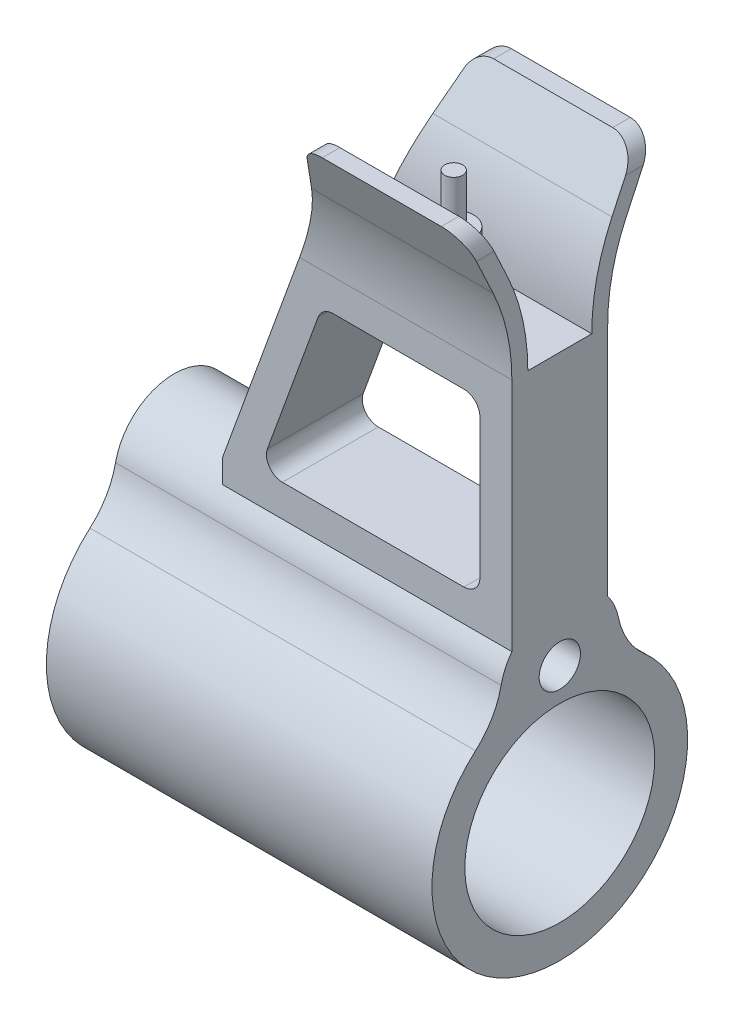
from build123d import *

# Parameters (mm, degrees)
SKETCH3_R           = 11.8872
SKETCH3_R_2         = 2.58445
BOSS_EXTRUDE1_DEPTH = 24.13
SKETCH4_R           = 1.5875
CUT_EXTRUDE3_DEPTH  = 15
BOSS_EXTRUDE2_DEPTH = 6
BOSS_EXTRUDE3_DEPTH = 24.13
BOSS_EXTRUDE4_START = -12
BOSS_EXTRUDE4_DEPTH = 12
CUT_EXTRUDE4_DEPTH  = 12.5
CUT_EXTRUDE5_DEPTH  = 25
CUT_EXTRUDE6_DEPTH  = 25
FILLET1_R           = 2
SKETCH10_R          = 2.5
BOSS_EXTRUDE6_DEPTH = 7
SKETCH12_R          = 1.125
BOSS_EXTRUDE7_DEPTH = 13.10696976


with BuildPart() as part:
    # Sketch3 → Boss-Extrude1 (new, symmetric)
    with BuildSketch(Plane(origin=(0, 0, 0), x_dir=(0, 0, -1), z_dir=(1, 0, 0))):
        with BuildLine():
            ThreePointArc((7.34364611, 17.5234375), (0, 23.5), (-7.34364611, 17.5234375))
            ThreePointArc((-7.34364611, 17.5234375), (-8.496496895, 14.517500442), (-10.544722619, 12.033653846))
            ThreePointArc((-10.544722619, 12.033653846), (0, -16), (10.544722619, 12.033653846))
            ThreePointArc((10.544722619, 12.033653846), (8.496496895, 14.517500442), (7.34364611, 17.5234375))
        make_face()
        with Locations(Location((0, 0, 0), (0, 0, 180))):
            Circle(SKETCH3_R, mode=Mode.SUBTRACT)
        with Locations(Location((0, 16, 0), (0, 0, 180))):
            Circle(SKETCH3_R_2, mode=Mode.SUBTRACT)
    extrude(amount=BOSS_EXTRUDE1_DEPTH, both=True)

    # Sketch4 → Cut-Extrude3 (cut)
    with BuildSketch(Plane(origin=(0, 0, 0), x_dir=(1, 0, 0), z_dir=(0, 1, 0))):
        with Locations(Location((-16.51, 0, 0), (0, 0, 90))):
            Circle(SKETCH4_R)
    extrude(amount=CUT_EXTRUDE3_DEPTH, mode=Mode.SUBTRACT)

    # Sketch5 → Boss-Extrude2 (add, symmetric)
    with BuildSketch(Plane.XY):
        with BuildLine():
            Line((24.13, 20.168652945), (24.13, 23.5))
            Line((24.13, 23.5), (24.13, 64.995396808))
            ThreePointArc((24.13, 64.995396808), (23.251320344, 67.116717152), (21.13, 67.995396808))
            Line((21.13, 67.995396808), (6.230622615, 67.995396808))
            ThreePointArc((6.230622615, 67.995396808), (4.509893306, 67.452852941), (3.411544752, 66.021457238))
            Line((3.411544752, 66.021457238), (-12.065, 23.5))
            Line((-12.065, 23.5), (-12.065, 20.168652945))
            Line((-12.065, 20.168652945), (24.13, 20.168652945))
        make_face()
    extrude(amount=BOSS_EXTRUDE2_DEPTH, both=True)

    # Sketch6 → Boss-Extrude3 (add)
    with BuildSketch(Plane(origin=(0, 0, 0), x_dir=(0, 0, -1), z_dir=(1, 0, 0))):
        with BuildLine():
            Line((-8.342305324, 60.518486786), (-11.828845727, 67.995396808))
            Line((-11.828845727, 67.995396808), (-6, 67.995396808))
            Line((-6, 67.995396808), (-6, 49.953030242))
            ThreePointArc((-6, 49.953030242), (-6.592599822, 55.36402059), (-8.342305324, 60.518486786))
        make_face()
        with BuildLine():
            Line((11.828845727, 67.995396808), (8.342305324, 60.518486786))
            ThreePointArc((8.342305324, 60.518486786), (6.592599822, 55.36402059), (6, 49.953030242))
            Line((6, 49.953030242), (6, 67.995396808))
            Line((6, 67.995396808), (11.828845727, 67.995396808))
        make_face()
    extrude(amount=BOSS_EXTRUDE3_DEPTH)

    # Sketch6_2 → Boss-Extrude4 (add)
    with BuildSketch(Plane(origin=(0, 0, 0), x_dir=(0, 0, -1), z_dir=(1, 0, 0)).offset(BOSS_EXTRUDE4_START)):
        with BuildLine():
            Line((-8.342305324, 60.518486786), (-11.828845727, 67.995396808))
            Line((-11.828845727, 67.995396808), (-6, 67.995396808))
            Line((-6, 67.995396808), (-6, 49.953030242))
            ThreePointArc((-6, 49.953030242), (-6.592599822, 55.36402059), (-8.342305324, 60.518486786))
        make_face()
        with BuildLine():
            Line((11.828845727, 67.995396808), (8.342305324, 60.518486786))
            ThreePointArc((8.342305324, 60.518486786), (6.592599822, 55.36402059), (6, 49.953030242))
            Line((6, 49.953030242), (6, 67.995396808))
            Line((6, 67.995396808), (11.828845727, 67.995396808))
        make_face()
    extrude(amount=BOSS_EXTRUDE4_DEPTH)

    # Sketch7 → Cut-Extrude4 (cut, symmetric)
    with BuildSketch(Plane.XY):
        with BuildLine():
            Line((40.403155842, 121.848988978), (-35.082785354, 121.848988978))
            Line((-35.082785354, 121.848988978), (-35.082785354, 49.953030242))
            Line((-35.082785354, 49.953030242), (-12, 49.953030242))
            Line((-12, 49.953030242), (-2.436884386, 49.953030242))
            Line((-2.436884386, 49.953030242), (3.411544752, 66.021457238))
            ThreePointArc((3.411544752, 66.021457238), (4.509893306, 67.452852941), (6.230622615, 67.995396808))
            Line((6.230622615, 67.995396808), (21.13, 67.995396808))
            ThreePointArc((21.13, 67.995396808), (23.251320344, 67.116717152), (24.13, 64.995396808))
            Line((24.13, 64.995396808), (24.13, 49.953030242))
            Line((24.13, 49.953030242), (40.403155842, 49.953030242))
            Line((40.403155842, 49.953030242), (40.403155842, 121.848988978))
        make_face()
    extrude(amount=CUT_EXTRUDE4_DEPTH, both=True, mode=Mode.SUBTRACT)

    # Sketch8 → Cut-Extrude5 (cut, symmetric)
    with BuildSketch(Plane(origin=(0, 0, 0), x_dir=(0, 0, -1), z_dir=(1, 0, 0))):
        with BuildLine():
            Line((-10.016230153, 68.840633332), (-8.617307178, 65.840633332))
            Line((-8.617307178, 65.840633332), (-6.52968975, 61.363723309))
            ThreePointArc((-6.52968975, 61.363723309), (-4.640007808, 55.796899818), (-4, 49.953030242))
            Line((-4, 49.953030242), (4, 49.953030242))
            ThreePointArc((4, 49.953030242), (4.640007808, 55.796899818), (6.52968975, 61.363723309))
            Line((6.52968975, 61.363723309), (8.617307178, 65.840633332))
            Line((8.617307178, 65.840633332), (10.016230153, 68.840633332))
            Line((10.016230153, 68.840633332), (-10.016230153, 68.840633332))
        make_face()
    extrude(amount=CUT_EXTRUDE5_DEPTH, both=True, mode=Mode.SUBTRACT)

    # Sketch9 → Cut-Extrude6 (cut, symmetric)
    with BuildSketch(Plane.XY):
        Polygon((20.13, 45.953030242), (0.363945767, 45.953030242), (-7.444318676, 24.5), (20.13, 24.5), align=None)
    extrude(amount=CUT_EXTRUDE6_DEPTH, both=True, mode=Mode.SUBTRACT)

    # Fillet1
    fillet1_edges = [part.edges().sort_by_distance(p)[0] for p in [
        (20.13, 45.953030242, 0),
        (20.13, 24.5, 0),
        (-7.444318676, 24.5, 0),
        (0.363945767, 45.953030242, 0),
    ]]
    fillet(fillet1_edges, radius=FILLET1_R)

    # Sketch10 → Boss-Extrude6 (add)
    with BuildSketch(Plane(origin=(0, 49.953030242, 0), x_dir=(1, 0, 0), z_dir=(0, 1, 0))):
        with Locations(Location((10.846557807, 0, 0), (0, 0, 90))):
            Circle(SKETCH10_R)
    extrude(amount=BOSS_EXTRUDE6_DEPTH)

    # Sketch12 → Boss-Extrude7 (add)
    with BuildSketch(Plane(origin=(0, 49.953030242, 0), x_dir=(1, 0, 0), z_dir=(0, 1, 0))):
        with Locations(Location((10.846557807, 0, 0), (0, 0, 270))):
            Circle(SKETCH12_R)
    extrude(amount=BOSS_EXTRUDE7_DEPTH)


solid = part.part
